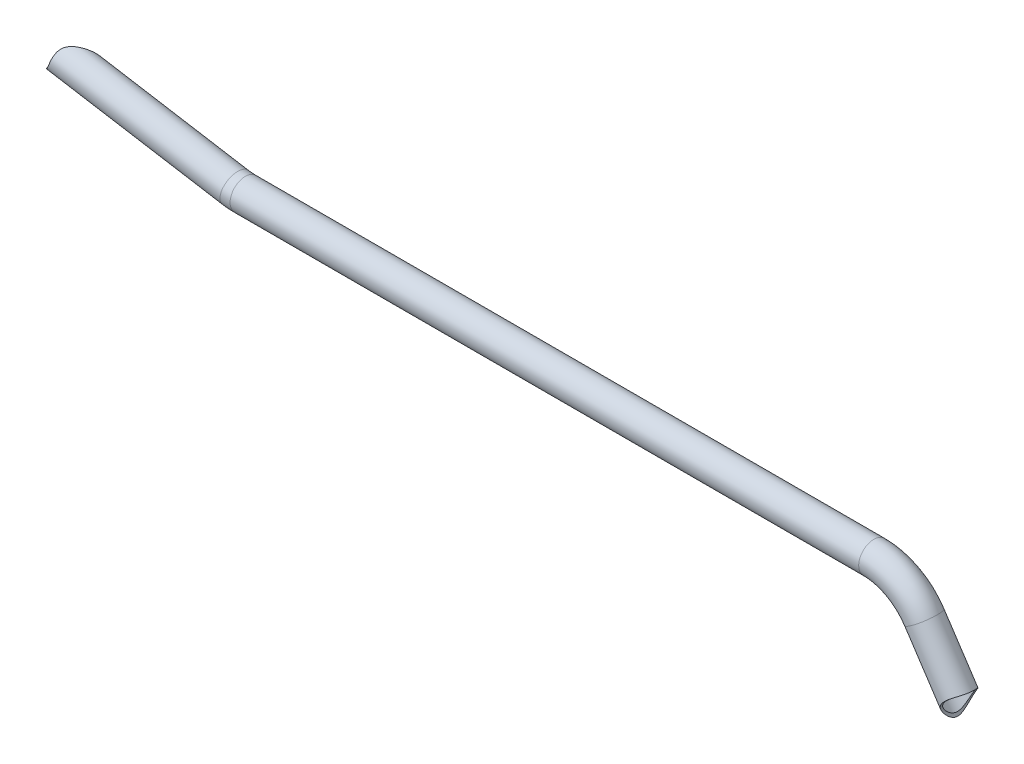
from build123d import *

# Parameters (mm, degrees)
ESQUISSE2_R             = 15
ESQUISSE2_R_2           = 13
ESQUISSE4_R             = 15
ENL_V_MAT_EXTRU_1_DEPTH = 508.381296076


with BuildPart() as part:
    # Balayage1: sweep along a path in Esquisse1
    with BuildLine(Plane.XY) as balayage1_path:
        Line((442.83179651, 0), (397.792060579, 68.098879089))
        ThreePointArc((397.792060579, 68.098879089), (376.155775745, 87.848522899), (347.747438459, 95))
        Line((347.747438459, 95), (-275.034248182, 95))
        ThreePointArc((-275.034248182, 95), (-279.983080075, 95.204439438), (-284.89818742, 95.81636457))
        Line((-284.89818742, 95.81636457), (-460, 125))
    # Esquisse2 → Balayage1 (sweep)
    with BuildSketch(Plane(origin=(-460, 125, 0), x_dir=(0, 0, 1), z_dir=(-0.9863939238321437, 0.16439898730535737, 0))):
        Circle(ESQUISSE2_R)
        Circle(ESQUISSE2_R_2, mode=Mode.SUBTRACT)
    sweep(path=balayage1_path.line)

    # Esquisse3 → Enl_vement de mati_re-R_volution1 (revolve, cut)
    with BuildSketch(Plane(origin=(0, 0, 0), x_dir=(-1, 0, 0), z_dir=(0, 1, 0))):
        Polygon((-437.665232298, -60.151013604), (-415.976343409, 59.905606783), (-445.498463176, 65.238940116), (-467.187352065, -54.817680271), align=None)
    revolve(axis=Axis((426.215352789, 0, 171.978620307), (0.17777777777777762, 0, -0.9840706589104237)), mode=Mode.SUBTRACT)

    # Esquisse4 → Enl_v. mat.-Extru.1 (cut, through all)
    with BuildSketch(Plane(origin=(24.315182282, 3.282492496, -27.941380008), x_dir=(-0.756383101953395, 0.05344897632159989, -0.6519415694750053), z_dir=(0.6538977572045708, 0.08827466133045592, -0.751415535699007))):
        with Locations((355.090844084, 136.557204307)):
            Circle(ESQUISSE4_R)
    extrude(amount=-ENL_V_MAT_EXTRU_1_DEPTH, mode=Mode.SUBTRACT)


solid = part.part
